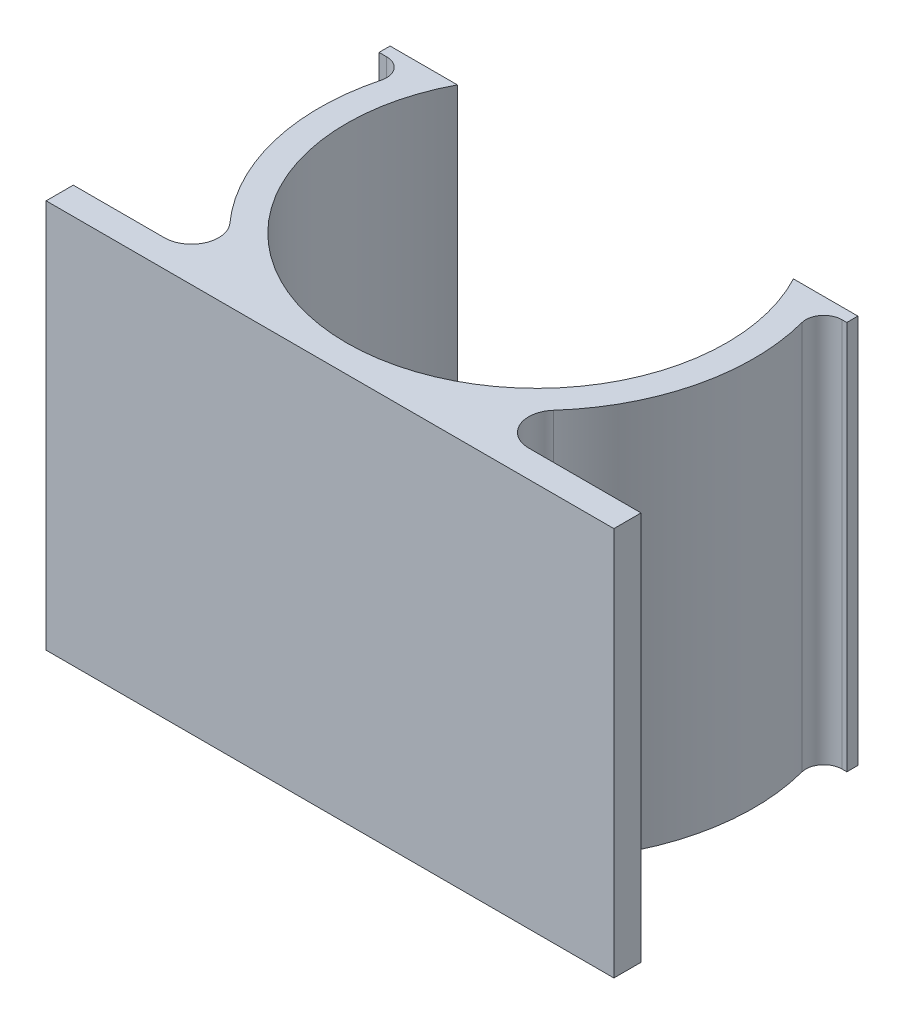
from build123d import *

# Parameters (mm, degrees)
EXTRUDE1_DEPTH = 21.5


with BuildPart() as part:
    # Sketch1 → Extrude1 (new body)
    with BuildSketch(Plane(origin=(0, 0, 0), x_dir=(1, 0, 0), z_dir=(0, 1, 0))):
        with BuildLine():
            Line((16.268907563, -12), (-15.095104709, -12))
            Line((-15.095104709, -12), (-15.095104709, -10.5))
            Line((-15.095104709, -10.5), (-10.062305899, -10.5))
            ThreePointArc((-10.062305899, -10.5), (-8.692999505, -9.612372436), (-8.94427191, -8))
            ThreePointArc((-8.94427191, -8), (-11.665430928, -2.81384457), (-11.60787502, 3.042570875))
            ThreePointArc((-11.60787502, 3.042570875), (-11.783507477, 3.907040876), (-12.575197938, 4.296118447))
            Line((-12.575197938, 4.296118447), (-13, 4.296118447))
            Line((-13, 4.296118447), (-13, 4.906495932))
            Line((-13, 4.906495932), (-9.283118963, 4.906495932))
            ThreePointArc((-9.283118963, 4.906495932), (0, -10.5), (9.283118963, 4.906495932))
            Line((9.283118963, 4.906495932), (12.841403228, 4.906495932))
            Line((12.841403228, 4.906495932), (12.841403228, 4.296118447))
            Line((12.841403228, 4.296118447), (12.575197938, 4.296118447))
            ThreePointArc((12.575197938, 4.296118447), (11.783507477, 3.907040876), (11.60787502, 3.042570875))
            ThreePointArc((11.60787502, 3.042570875), (11.665430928, -2.81384457), (8.94427191, -8))
            ThreePointArc((8.94427191, -8), (8.692999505, -9.612372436), (10.062305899, -10.5))
            Line((10.062305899, -10.5), (16.268907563, -10.5))
            Line((16.268907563, -10.5), (16.268907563, -12))
        make_face()
    extrude(amount=EXTRUDE1_DEPTH)


solid = part.part
